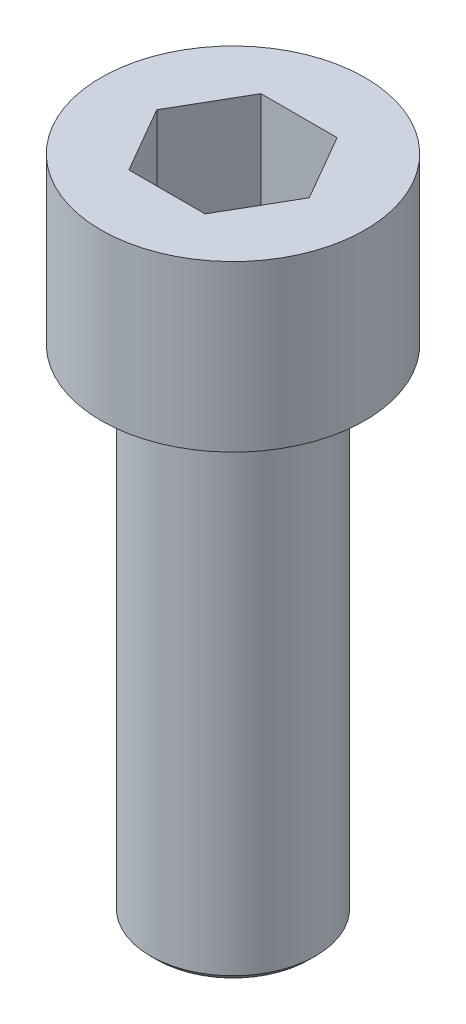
from build123d import *

# Parameters (mm, degrees)
CUT_EXTRUDE1_DEPTH = 3
FILLET1_R          = 0.2
CHAMFER1_SIZE      = 0.2


with BuildPart() as part:
    # Sketch1 → Revolve1 (revolve)
    with BuildSketch(Plane.XY, mode=Mode.PRIVATE) as revolve1_sk:
        Polygon((0, 0), (2.5, 0), (2.5, 15), (4, 15), (4, 20), (0, 20), align=None)
    revolve(revolve1_sk.sketch.rotate(Axis((0, 124.161982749, 0), (0, -1, 0)), 90), axis=Axis((0, 124.161982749, 0), (0, -1, 0)))

    # Sketch2 → Cut-Extrude1 (cut)
    with BuildSketch(Plane(origin=(0, 20, 0), x_dir=(1, 0, 0), z_dir=(0, 1, 0))):
        Polygon((2.309401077, 0), (1.154700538, 2), (-1.154700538, 2), (-2.309401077, 0), (-1.154700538, -2), (1.154700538, -2), align=None)
    extrude(amount=-CUT_EXTRUDE1_DEPTH, mode=Mode.SUBTRACT)

    # Fillet1
    fillet1_edges = [part.edges().sort_by_distance(p)[0] for p in [
        (0, 15, -2.5),
    ]]
    fillet(fillet1_edges, radius=FILLET1_R)

    # Chamfer1
    chamfer1_edges = [part.edges().sort_by_distance(p)[0] for p in [
        (0, 0, -2.5),
    ]]
    chamfer(chamfer1_edges, length=CHAMFER1_SIZE)


solid = part.part
